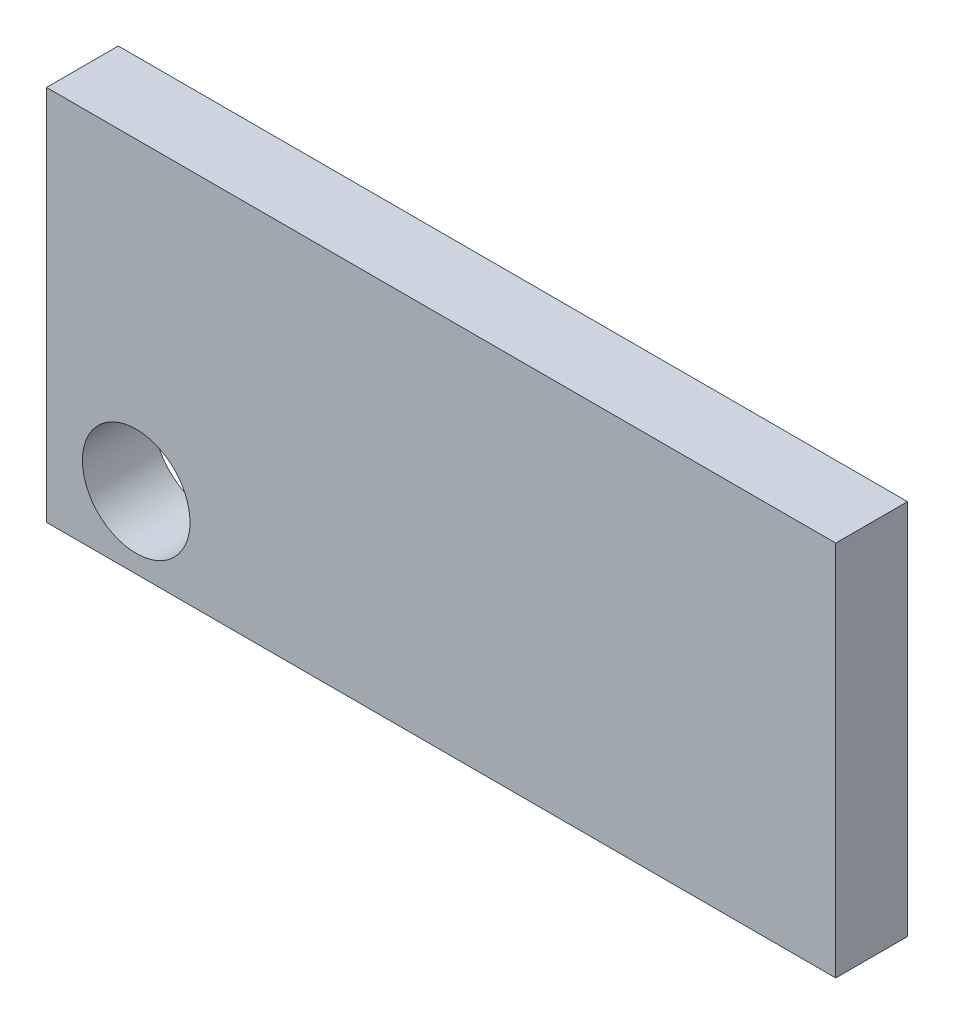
ISO-10303-21;
HEADER;
FILE_DESCRIPTION(('STEP AP214'),'2;1');
FILE_NAME('part.step','',(''),(''),'','','');
FILE_SCHEMA(('AUTOMOTIVE_DESIGN { 1 0 10303 214 1 1 1 1 }'));
ENDSEC;
DATA;
#1=APPLICATION_CONTEXT('core data for automotive mechanical design processes');
#2=APPLICATION_PROTOCOL_DEFINITION('international standard','automotive_design',2000,#1);
#3=PRODUCT_CONTEXT('',#1,'mechanical');
#4=PRODUCT('Part','Part','',(#3));
#5=PRODUCT_RELATED_PRODUCT_CATEGORY('part','',(#4));
#6=PRODUCT_DEFINITION_FORMATION('','',#4);
#7=PRODUCT_DEFINITION_CONTEXT('part definition',#1,'design');
#8=PRODUCT_DEFINITION('design','',#6,#7);
#9=PRODUCT_DEFINITION_SHAPE('','',#8);
#10=(LENGTH_UNIT() NAMED_UNIT(*) SI_UNIT(.MILLI.,.METRE.));
#11=(NAMED_UNIT(*) PLANE_ANGLE_UNIT() SI_UNIT($,.RADIAN.));
#12=(NAMED_UNIT(*) SI_UNIT($,.STERADIAN.) SOLID_ANGLE_UNIT());
#13=UNCERTAINTY_MEASURE_WITH_UNIT(LENGTH_MEASURE(1.E-05),#10,'distance_accuracy_value','');
#14=(GEOMETRIC_REPRESENTATION_CONTEXT(3) GLOBAL_UNCERTAINTY_ASSIGNED_CONTEXT((#13)) GLOBAL_UNIT_ASSIGNED_CONTEXT((#10,
#11,#12)) REPRESENTATION_CONTEXT('',''));
#15=CARTESIAN_POINT('',(0.,0.,0.));
#16=DIRECTION('',(0.,0.,1.));
#17=DIRECTION('',(1.,0.,0.));
#18=AXIS2_PLACEMENT_3D('',#15,#16,#17);
#19=CARTESIAN_POINT('',(127.,457.2,50.8));
#20=DIRECTION('',(0.,0.,-1.));
#21=DIRECTION('',(-1.,0.,0.));
#22=AXIS2_PLACEMENT_3D('',#19,#20,#21);
#23=PLANE('',#22);
#24=CARTESIAN_POINT('',(127.,457.2,50.8));
#25=DIRECTION('',(0.,0.,-1.));
#26=DIRECTION('',(-1.,0.,0.));
#27=AXIS2_PLACEMENT_3D('',#24,#25,#26);
#28=CIRCLE('',#27,4.88950000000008);
#29=CARTESIAN_POINT('',(122.1105,457.2,50.8));
#30=VERTEX_POINT('',#29);
#31=EDGE_CURVE('E11',#30,#30,#28,.T.);
#32=ORIENTED_EDGE('',*,*,#31,.T.);
#33=EDGE_LOOP('',(#32));
#34=FACE_BOUND('',#33,.T.);
#35=ADVANCED_FACE('F32',(#34),#23,.T.);
#36=CARTESIAN_POINT('',(127.,457.2,50.8));
#37=DIRECTION('',(0.,0.,-1.));
#38=DIRECTION('',(-1.,0.,0.));
#39=AXIS2_PLACEMENT_3D('',#36,#37,#38);
#40=CYLINDRICAL_SURFACE('',#39,4.88950000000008);
#41=ORIENTED_EDGE('',*,*,#31,.F.);
#42=EDGE_LOOP('',(#41));
#43=FACE_BOUND('',#42,.T.);
#44=CARTESIAN_POINT('',(127.,457.2,0.));
#45=DIRECTION('',(0.,0.,-1.));
#46=DIRECTION('',(-1.,0.,0.));
#47=AXIS2_PLACEMENT_3D('',#44,#45,#46);
#48=CIRCLE('',#47,4.88950000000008);
#49=CARTESIAN_POINT('',(122.1105,457.2,0.));
#50=VERTEX_POINT('',#49);
#51=EDGE_CURVE('E40',#50,#50,#48,.T.);
#52=ORIENTED_EDGE('',*,*,#51,.T.);
#53=EDGE_LOOP('',(#52));
#54=FACE_BOUND('',#53,.T.);
#55=ADVANCED_FACE('F153',(#43,#54),#40,.F.);
#56=CARTESIAN_POINT('',(228.6,457.2,50.8));
#57=DIRECTION('',(0.,0.,-1.));
#58=DIRECTION('',(-1.,0.,0.));
#59=AXIS2_PLACEMENT_3D('',#56,#57,#58);
#60=PLANE('',#59);
#61=CARTESIAN_POINT('',(228.6,457.2,50.8));
#62=DIRECTION('',(0.,0.,-1.));
#63=DIRECTION('',(-1.,0.,0.));
#64=AXIS2_PLACEMENT_3D('',#61,#62,#63);
#65=CIRCLE('',#64,4.88950000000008);
#66=CARTESIAN_POINT('',(223.7105,457.2,50.8));
#67=VERTEX_POINT('',#66);
#68=EDGE_CURVE('E148',#67,#67,#65,.T.);
#69=ORIENTED_EDGE('',*,*,#68,.T.);
#70=EDGE_LOOP('',(#69));
#71=FACE_BOUND('',#70,.T.);
#72=ADVANCED_FACE('F178',(#71),#60,.T.);
#73=CARTESIAN_POINT('',(228.6,457.2,50.8));
#74=DIRECTION('',(0.,0.,-1.));
#75=DIRECTION('',(-1.,0.,0.));
#76=AXIS2_PLACEMENT_3D('',#73,#74,#75);
#77=CYLINDRICAL_SURFACE('',#76,4.88950000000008);
#78=ORIENTED_EDGE('',*,*,#68,.F.);
#79=EDGE_LOOP('',(#78));
#80=FACE_BOUND('',#79,.T.);
#81=CARTESIAN_POINT('',(228.6,457.2,0.));
#82=DIRECTION('',(0.,0.,-1.));
#83=DIRECTION('',(-1.,0.,0.));
#84=AXIS2_PLACEMENT_3D('',#81,#82,#83);
#85=CIRCLE('',#84,4.88950000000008);
#86=CARTESIAN_POINT('',(223.7105,457.2,0.));
#87=VERTEX_POINT('',#86);
#88=EDGE_CURVE('E145',#87,#87,#85,.T.);
#89=ORIENTED_EDGE('',*,*,#88,.T.);
#90=EDGE_LOOP('',(#89));
#91=FACE_BOUND('',#90,.T.);
#92=ADVANCED_FACE('F184',(#80,#91),#77,.F.);
#93=CARTESIAN_POINT('',(330.2,457.2,50.8));
#94=DIRECTION('',(0.,0.,-1.));
#95=DIRECTION('',(-1.,0.,0.));
#96=AXIS2_PLACEMENT_3D('',#93,#94,#95);
#97=PLANE('',#96);
#98=CARTESIAN_POINT('',(330.2,457.2,50.8));
#99=DIRECTION('',(0.,0.,-1.));
#100=DIRECTION('',(-1.,0.,0.));
#101=AXIS2_PLACEMENT_3D('',#98,#99,#100);
#102=CIRCLE('',#101,4.88950000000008);
#103=CARTESIAN_POINT('',(325.3105,457.2,50.8));
#104=VERTEX_POINT('',#103);
#105=EDGE_CURVE('E142',#104,#104,#102,.T.);
#106=ORIENTED_EDGE('',*,*,#105,.T.);
#107=EDGE_LOOP('',(#106));
#108=FACE_BOUND('',#107,.T.);
#109=ADVANCED_FACE('F190',(#108),#97,.T.);
#110=CARTESIAN_POINT('',(330.2,457.2,50.8));
#111=DIRECTION('',(0.,0.,-1.));
#112=DIRECTION('',(-1.,0.,0.));
#113=AXIS2_PLACEMENT_3D('',#110,#111,#112);
#114=CYLINDRICAL_SURFACE('',#113,4.88950000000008);
#115=ORIENTED_EDGE('',*,*,#105,.F.);
#116=EDGE_LOOP('',(#115));
#117=FACE_BOUND('',#116,.T.);
#118=CARTESIAN_POINT('',(330.2,457.2,0.));
#119=DIRECTION('',(0.,0.,-1.));
#120=DIRECTION('',(-1.,0.,0.));
#121=AXIS2_PLACEMENT_3D('',#118,#119,#120);
#122=CIRCLE('',#121,4.88950000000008);
#123=CARTESIAN_POINT('',(325.3105,457.2,0.));
#124=VERTEX_POINT('',#123);
#125=EDGE_CURVE('E139',#124,#124,#122,.T.);
#126=ORIENTED_EDGE('',*,*,#125,.T.);
#127=EDGE_LOOP('',(#126));
#128=FACE_BOUND('',#127,.T.);
#129=ADVANCED_FACE('F194',(#117,#128),#114,.F.);
#130=CARTESIAN_POINT('',(431.8,457.2,50.8));
#131=DIRECTION('',(0.,0.,-1.));
#132=DIRECTION('',(-1.,0.,0.));
#133=AXIS2_PLACEMENT_3D('',#130,#131,#132);
#134=PLANE('',#133);
#135=CARTESIAN_POINT('',(431.8,457.2,50.8));
#136=DIRECTION('',(0.,0.,-1.));
#137=DIRECTION('',(-1.,0.,0.));
#138=AXIS2_PLACEMENT_3D('',#135,#136,#137);
#139=CIRCLE('',#138,4.88950000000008);
#140=CARTESIAN_POINT('',(426.9105,457.2,50.8));
#141=VERTEX_POINT('',#140);
#142=EDGE_CURVE('E136',#141,#141,#139,.T.);
#143=ORIENTED_EDGE('',*,*,#142,.T.);
#144=EDGE_LOOP('',(#143));
#145=FACE_BOUND('',#144,.T.);
#146=ADVANCED_FACE('F198',(#145),#134,.T.);
#147=CARTESIAN_POINT('',(431.8,457.2,50.8));
#148=DIRECTION('',(0.,0.,-1.));
#149=DIRECTION('',(-1.,0.,0.));
#150=AXIS2_PLACEMENT_3D('',#147,#148,#149);
#151=CYLINDRICAL_SURFACE('',#150,4.88950000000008);
#152=ORIENTED_EDGE('',*,*,#142,.F.);
#153=EDGE_LOOP('',(#152));
#154=FACE_BOUND('',#153,.T.);
#155=CARTESIAN_POINT('',(431.8,457.2,0.));
#156=DIRECTION('',(0.,0.,-1.));
#157=DIRECTION('',(-1.,0.,0.));
#158=AXIS2_PLACEMENT_3D('',#155,#156,#157);
#159=CIRCLE('',#158,4.88950000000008);
#160=CARTESIAN_POINT('',(426.9105,457.2,0.));
#161=VERTEX_POINT('',#160);
#162=EDGE_CURVE('E133',#161,#161,#159,.T.);
#163=ORIENTED_EDGE('',*,*,#162,.T.);
#164=EDGE_LOOP('',(#163));
#165=FACE_BOUND('',#164,.T.);
#166=ADVANCED_FACE('F202',(#154,#165),#151,.F.);
#167=CARTESIAN_POINT('',(533.4,457.2,50.8));
#168=DIRECTION('',(0.,0.,-1.));
#169=DIRECTION('',(-1.,0.,0.));
#170=AXIS2_PLACEMENT_3D('',#167,#168,#169);
#171=PLANE('',#170);
#172=CARTESIAN_POINT('',(533.4,457.2,50.8));
#173=DIRECTION('',(0.,0.,-1.));
#174=DIRECTION('',(-1.,0.,0.));
#175=AXIS2_PLACEMENT_3D('',#172,#173,#174);
#176=CIRCLE('',#175,4.88950000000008);
#177=CARTESIAN_POINT('',(528.5105,457.2,50.8));
#178=VERTEX_POINT('',#177);
#179=EDGE_CURVE('E130',#178,#178,#176,.T.);
#180=ORIENTED_EDGE('',*,*,#179,.T.);
#181=EDGE_LOOP('',(#180));
#182=FACE_BOUND('',#181,.T.);
#183=ADVANCED_FACE('F206',(#182),#171,.T.);
#184=CARTESIAN_POINT('',(533.4,457.2,50.8));
#185=DIRECTION('',(0.,0.,-1.));
#186=DIRECTION('',(-1.,0.,0.));
#187=AXIS2_PLACEMENT_3D('',#184,#185,#186);
#188=CYLINDRICAL_SURFACE('',#187,4.88950000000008);
#189=ORIENTED_EDGE('',*,*,#179,.F.);
#190=EDGE_LOOP('',(#189));
#191=FACE_BOUND('',#190,.T.);
#192=CARTESIAN_POINT('',(533.4,457.2,0.));
#193=DIRECTION('',(0.,0.,-1.));
#194=DIRECTION('',(-1.,0.,0.));
#195=AXIS2_PLACEMENT_3D('',#192,#193,#194);
#196=CIRCLE('',#195,4.88950000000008);
#197=CARTESIAN_POINT('',(528.5105,457.2,0.));
#198=VERTEX_POINT('',#197);
#199=EDGE_CURVE('E127',#198,#198,#196,.T.);
#200=ORIENTED_EDGE('',*,*,#199,.T.);
#201=EDGE_LOOP('',(#200));
#202=FACE_BOUND('',#201,.T.);
#203=ADVANCED_FACE('F210',(#191,#202),#188,.F.);
#204=CARTESIAN_POINT('',(635.,457.2,50.8));
#205=DIRECTION('',(0.,0.,-1.));
#206=DIRECTION('',(-1.,0.,0.));
#207=AXIS2_PLACEMENT_3D('',#204,#205,#206);
#208=PLANE('',#207);
#209=CARTESIAN_POINT('',(635.,457.2,50.8));
#210=DIRECTION('',(0.,0.,-1.));
#211=DIRECTION('',(-1.,0.,0.));
#212=AXIS2_PLACEMENT_3D('',#209,#210,#211);
#213=CIRCLE('',#212,4.88950000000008);
#214=CARTESIAN_POINT('',(630.1105,457.2,50.8));
#215=VERTEX_POINT('',#214);
#216=EDGE_CURVE('E124',#215,#215,#213,.T.);
#217=ORIENTED_EDGE('',*,*,#216,.T.);
#218=EDGE_LOOP('',(#217));
#219=FACE_BOUND('',#218,.T.);
#220=ADVANCED_FACE('F214',(#219),#208,.T.);
#221=CARTESIAN_POINT('',(635.,457.2,50.8));
#222=DIRECTION('',(0.,0.,-1.));
#223=DIRECTION('',(-1.,0.,0.));
#224=AXIS2_PLACEMENT_3D('',#221,#222,#223);
#225=CYLINDRICAL_SURFACE('',#224,4.88950000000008);
#226=ORIENTED_EDGE('',*,*,#216,.F.);
#227=EDGE_LOOP('',(#226));
#228=FACE_BOUND('',#227,.T.);
#229=CARTESIAN_POINT('',(635.,457.2,0.));
#230=DIRECTION('',(0.,0.,-1.));
#231=DIRECTION('',(-1.,0.,0.));
#232=AXIS2_PLACEMENT_3D('',#229,#230,#231);
#233=CIRCLE('',#232,4.88950000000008);
#234=CARTESIAN_POINT('',(630.1105,457.2,0.));
#235=VERTEX_POINT('',#234);
#236=EDGE_CURVE('E121',#235,#235,#233,.T.);
#237=ORIENTED_EDGE('',*,*,#236,.T.);
#238=EDGE_LOOP('',(#237));
#239=FACE_BOUND('',#238,.T.);
#240=ADVANCED_FACE('F218',(#228,#239),#225,.F.);
#241=CARTESIAN_POINT('',(736.6,457.2,50.8));
#242=DIRECTION('',(0.,0.,-1.));
#243=DIRECTION('',(-1.,0.,0.));
#244=AXIS2_PLACEMENT_3D('',#241,#242,#243);
#245=PLANE('',#244);
#246=CARTESIAN_POINT('',(736.6,457.2,50.8));
#247=DIRECTION('',(0.,0.,-1.));
#248=DIRECTION('',(-1.,0.,0.));
#249=AXIS2_PLACEMENT_3D('',#246,#247,#248);
#250=CIRCLE('',#249,4.88950000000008);
#251=CARTESIAN_POINT('',(731.7105,457.2,50.8));
#252=VERTEX_POINT('',#251);
#253=EDGE_CURVE('E118',#252,#252,#250,.T.);
#254=ORIENTED_EDGE('',*,*,#253,.T.);
#255=EDGE_LOOP('',(#254));
#256=FACE_BOUND('',#255,.T.);
#257=ADVANCED_FACE('F222',(#256),#245,.T.);
#258=CARTESIAN_POINT('',(736.6,457.2,50.8));
#259=DIRECTION('',(0.,0.,-1.));
#260=DIRECTION('',(-1.,0.,0.));
#261=AXIS2_PLACEMENT_3D('',#258,#259,#260);
#262=CYLINDRICAL_SURFACE('',#261,4.88950000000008);
#263=ORIENTED_EDGE('',*,*,#253,.F.);
#264=EDGE_LOOP('',(#263));
#265=FACE_BOUND('',#264,.T.);
#266=CARTESIAN_POINT('',(736.6,457.2,0.));
#267=DIRECTION('',(0.,0.,-1.));
#268=DIRECTION('',(-1.,0.,0.));
#269=AXIS2_PLACEMENT_3D('',#266,#267,#268);
#270=CIRCLE('',#269,4.88950000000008);
#271=CARTESIAN_POINT('',(731.7105,457.2,0.));
#272=VERTEX_POINT('',#271);
#273=EDGE_CURVE('E115',#272,#272,#270,.T.);
#274=ORIENTED_EDGE('',*,*,#273,.T.);
#275=EDGE_LOOP('',(#274));
#276=FACE_BOUND('',#275,.T.);
#277=ADVANCED_FACE('F226',(#265,#276),#262,.F.);
#278=CARTESIAN_POINT('',(838.2,457.2,50.8));
#279=DIRECTION('',(0.,0.,-1.));
#280=DIRECTION('',(-1.,0.,0.));
#281=AXIS2_PLACEMENT_3D('',#278,#279,#280);
#282=PLANE('',#281);
#283=CARTESIAN_POINT('',(838.2,457.2,50.8));
#284=DIRECTION('',(0.,0.,-1.));
#285=DIRECTION('',(-1.,0.,0.));
#286=AXIS2_PLACEMENT_3D('',#283,#284,#285);
#287=CIRCLE('',#286,4.88950000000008);
#288=CARTESIAN_POINT('',(833.3105,457.2,50.8));
#289=VERTEX_POINT('',#288);
#290=EDGE_CURVE('E112',#289,#289,#287,.T.);
#291=ORIENTED_EDGE('',*,*,#290,.T.);
#292=EDGE_LOOP('',(#291));
#293=FACE_BOUND('',#292,.T.);
#294=ADVANCED_FACE('F230',(#293),#282,.T.);
#295=CARTESIAN_POINT('',(838.2,457.2,50.8));
#296=DIRECTION('',(0.,0.,-1.));
#297=DIRECTION('',(-1.,0.,0.));
#298=AXIS2_PLACEMENT_3D('',#295,#296,#297);
#299=CYLINDRICAL_SURFACE('',#298,4.88950000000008);
#300=ORIENTED_EDGE('',*,*,#290,.F.);
#301=EDGE_LOOP('',(#300));
#302=FACE_BOUND('',#301,.T.);
#303=CARTESIAN_POINT('',(838.2,457.2,0.));
#304=DIRECTION('',(0.,0.,-1.));
#305=DIRECTION('',(-1.,0.,0.));
#306=AXIS2_PLACEMENT_3D('',#303,#304,#305);
#307=CIRCLE('',#306,4.88950000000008);
#308=CARTESIAN_POINT('',(833.3105,457.2,0.));
#309=VERTEX_POINT('',#308);
#310=EDGE_CURVE('E109',#309,#309,#307,.T.);
#311=ORIENTED_EDGE('',*,*,#310,.T.);
#312=EDGE_LOOP('',(#311));
#313=FACE_BOUND('',#312,.T.);
#314=ADVANCED_FACE('F234',(#302,#313),#299,.F.);
#315=CARTESIAN_POINT('',(0.,0.,101.6));
#316=DIRECTION('',(1.,0.,0.));
#317=DIRECTION('',(0.,0.,-1.));
#318=AXIS2_PLACEMENT_3D('',#315,#316,#317);
#319=PLANE('',#318);
#320=DIRECTION('',(0.,-1.,0.));
#321=VECTOR('',#320,1.);
#322=CARTESIAN_POINT('',(0.,0.,0.));
#323=LINE('',#322,#321);
#324=CARTESIAN_POINT('',(0.,533.4,0.));
#325=VERTEX_POINT('',#324);
#326=CARTESIAN_POINT('',(0.,0.,0.));
#327=VERTEX_POINT('',#326);
#328=EDGE_CURVE('E99',#325,#327,#323,.T.);
#329=ORIENTED_EDGE('',*,*,#328,.T.);
#330=DIRECTION('',(0.,0.,-1.));
#331=VECTOR('',#330,1.);
#332=CARTESIAN_POINT('',(0.,0.,101.6));
#333=LINE('',#332,#331);
#334=CARTESIAN_POINT('',(0.,0.,101.6));
#335=VERTEX_POINT('',#334);
#336=EDGE_CURVE('E90',#335,#327,#333,.T.);
#337=ORIENTED_EDGE('',*,*,#336,.F.);
#338=DIRECTION('',(0.,-1.,0.));
#339=VECTOR('',#338,1.);
#340=CARTESIAN_POINT('',(0.,0.,101.6));
#341=LINE('',#340,#339);
#342=CARTESIAN_POINT('',(0.,533.4,101.6));
#343=VERTEX_POINT('',#342);
#344=EDGE_CURVE('E84',#343,#335,#341,.T.);
#345=ORIENTED_EDGE('',*,*,#344,.F.);
#346=DIRECTION('',(0.,0.,-1.));
#347=VECTOR('',#346,1.);
#348=CARTESIAN_POINT('',(0.,533.4,101.6));
#349=LINE('',#348,#347);
#350=EDGE_CURVE('E95',#343,#325,#349,.T.);
#351=ORIENTED_EDGE('',*,*,#350,.T.);
#352=EDGE_LOOP('',(#329,#337,#345,#351));
#353=FACE_BOUND('',#352,.T.);
#354=ADVANCED_FACE('F238',(#353),#319,.F.);
#355=CARTESIAN_POINT('',(0.,0.,101.6));
#356=DIRECTION('',(0.,1.,0.));
#357=DIRECTION('',(0.,0.,1.));
#358=AXIS2_PLACEMENT_3D('',#355,#356,#357);
#359=PLANE('',#358);
#360=DIRECTION('',(1.,0.,0.));
#361=VECTOR('',#360,1.);
#362=CARTESIAN_POINT('',(0.,0.,0.));
#363=LINE('',#362,#361);
#364=CARTESIAN_POINT('',(1117.6,0.,0.));
#365=VERTEX_POINT('',#364);
#366=EDGE_CURVE('E89',#327,#365,#363,.T.);
#367=ORIENTED_EDGE('',*,*,#366,.T.);
#368=DIRECTION('',(0.,0.,-1.));
#369=VECTOR('',#368,1.);
#370=CARTESIAN_POINT('',(1117.6,0.,101.6));
#371=LINE('',#370,#369);
#372=CARTESIAN_POINT('',(1117.6,0.,101.6));
#373=VERTEX_POINT('',#372);
#374=EDGE_CURVE('E87',#373,#365,#371,.T.);
#375=ORIENTED_EDGE('',*,*,#374,.F.);
#376=DIRECTION('',(1.,0.,0.));
#377=VECTOR('',#376,1.);
#378=CARTESIAN_POINT('',(0.,0.,101.6));
#379=LINE('',#378,#377);
#380=EDGE_CURVE('E79',#335,#373,#379,.T.);
#381=ORIENTED_EDGE('',*,*,#380,.F.);
#382=ORIENTED_EDGE('',*,*,#336,.T.);
#383=EDGE_LOOP('',(#367,#375,#381,#382));
#384=FACE_BOUND('',#383,.T.);
#385=ADVANCED_FACE('F88',(#384),#359,.F.);
#386=CARTESIAN_POINT('',(1117.6,0.,101.6));
#387=DIRECTION('',(-1.,0.,0.));
#388=DIRECTION('',(0.,0.,1.));
#389=AXIS2_PLACEMENT_3D('',#386,#387,#388);
#390=PLANE('',#389);
#391=DIRECTION('',(0.,1.,0.));
#392=VECTOR('',#391,1.);
#393=CARTESIAN_POINT('',(1117.6,0.,0.));
#394=LINE('',#393,#392);
#395=CARTESIAN_POINT('',(1117.6,533.4,0.));
#396=VERTEX_POINT('',#395);
#397=EDGE_CURVE('E65',#365,#396,#394,.T.);
#398=ORIENTED_EDGE('',*,*,#397,.T.);
#399=DIRECTION('',(0.,0.,-1.));
#400=VECTOR('',#399,1.);
#401=CARTESIAN_POINT('',(1117.6,533.4,101.6));
#402=LINE('',#401,#400);
#403=CARTESIAN_POINT('',(1117.6,533.4,101.6));
#404=VERTEX_POINT('',#403);
#405=EDGE_CURVE('E91',#404,#396,#402,.T.);
#406=ORIENTED_EDGE('',*,*,#405,.F.);
#407=DIRECTION('',(0.,1.,0.));
#408=VECTOR('',#407,1.);
#409=CARTESIAN_POINT('',(1117.6,0.,101.6));
#410=LINE('',#409,#408);
#411=EDGE_CURVE('E82',#373,#404,#410,.T.);
#412=ORIENTED_EDGE('',*,*,#411,.F.);
#413=ORIENTED_EDGE('',*,*,#374,.T.);
#414=EDGE_LOOP('',(#398,#406,#412,#413));
#415=FACE_BOUND('',#414,.T.);
#416=ADVANCED_FACE('F93',(#415),#390,.F.);
#417=CARTESIAN_POINT('',(0.,533.4,101.6));
#418=DIRECTION('',(0.,-1.,0.));
#419=DIRECTION('',(0.,0.,-1.));
#420=AXIS2_PLACEMENT_3D('',#417,#418,#419);
#421=PLANE('',#420);
#422=DIRECTION('',(-1.,0.,0.));
#423=VECTOR('',#422,1.);
#424=CARTESIAN_POINT('',(0.,533.4,0.));
#425=LINE('',#424,#423);
#426=EDGE_CURVE('E71',#396,#325,#425,.T.);
#427=ORIENTED_EDGE('',*,*,#426,.T.);
#428=ORIENTED_EDGE('',*,*,#350,.F.);
#429=DIRECTION('',(-1.,0.,0.));
#430=VECTOR('',#429,1.);
#431=CARTESIAN_POINT('',(0.,533.4,101.6));
#432=LINE('',#431,#430);
#433=EDGE_CURVE('E48',#404,#343,#432,.T.);
#434=ORIENTED_EDGE('',*,*,#433,.F.);
#435=ORIENTED_EDGE('',*,*,#405,.T.);
#436=EDGE_LOOP('',(#427,#428,#434,#435));
#437=FACE_BOUND('',#436,.T.);
#438=ADVANCED_FACE('F167',(#437),#421,.F.);
#439=CARTESIAN_POINT('',(0.,0.,101.6));
#440=DIRECTION('',(0.,0.,-1.));
#441=DIRECTION('',(-1.,0.,0.));
#442=AXIS2_PLACEMENT_3D('',#439,#440,#441);
#443=PLANE('',#442);
#444=CARTESIAN_POINT('',(127.,101.6,101.6));
#445=DIRECTION('',(0.,0.,-1.));
#446=DIRECTION('',(-1.,0.,0.));
#447=AXIS2_PLACEMENT_3D('',#444,#445,#446);
#448=CIRCLE('',#447,76.2);
#449=CARTESIAN_POINT('',(50.8,101.6,101.6));
#450=VERTEX_POINT('',#449);
#451=EDGE_CURVE('E102',#450,#450,#448,.T.);
#452=ORIENTED_EDGE('',*,*,#451,.T.);
#453=EDGE_LOOP('',(#452));
#454=FACE_BOUND('',#453,.T.);
#455=ORIENTED_EDGE('',*,*,#344,.T.);
#456=ORIENTED_EDGE('',*,*,#380,.T.);
#457=ORIENTED_EDGE('',*,*,#411,.T.);
#458=ORIENTED_EDGE('',*,*,#433,.T.);
#459=EDGE_LOOP('',(#455,#456,#457,#458));
#460=FACE_BOUND('',#459,.T.);
#461=ADVANCED_FACE('F80',(#454,#460),#443,.F.);
#462=CARTESIAN_POINT('',(0.,0.,0.));
#463=DIRECTION('',(0.,0.,-1.));
#464=DIRECTION('',(-1.,0.,0.));
#465=AXIS2_PLACEMENT_3D('',#462,#463,#464);
#466=PLANE('',#465);
#467=CARTESIAN_POINT('',(939.8,457.2,0.));
#468=DIRECTION('',(0.,0.,-1.));
#469=DIRECTION('',(-1.,0.,0.));
#470=AXIS2_PLACEMENT_3D('',#467,#468,#469);
#471=CIRCLE('',#470,4.88950000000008);
#472=CARTESIAN_POINT('',(934.9105,457.2,0.));
#473=VERTEX_POINT('',#472);
#474=EDGE_CURVE('E404',#473,#473,#471,.T.);
#475=ORIENTED_EDGE('',*,*,#474,.F.);
#476=EDGE_LOOP('',(#475));
#477=FACE_BOUND('',#476,.T.);
#478=CARTESIAN_POINT('',(1041.4,457.2,0.));
#479=DIRECTION('',(0.,0.,-1.));
#480=DIRECTION('',(-1.,0.,0.));
#481=AXIS2_PLACEMENT_3D('',#478,#479,#480);
#482=CIRCLE('',#481,4.88950000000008);
#483=CARTESIAN_POINT('',(1036.5105,457.2,0.));
#484=VERTEX_POINT('',#483);
#485=EDGE_CURVE('E403',#484,#484,#482,.T.);
#486=ORIENTED_EDGE('',*,*,#485,.F.);
#487=EDGE_LOOP('',(#486));
#488=FACE_BOUND('',#487,.T.);
#489=CARTESIAN_POINT('',(127.,101.6,0.));
#490=DIRECTION('',(0.,0.,-1.));
#491=DIRECTION('',(-1.,0.,0.));
#492=AXIS2_PLACEMENT_3D('',#489,#490,#491);
#493=CIRCLE('',#492,76.2);
#494=CARTESIAN_POINT('',(50.8,101.6,0.));
#495=VERTEX_POINT('',#494);
#496=EDGE_CURVE('E413',#495,#495,#493,.T.);
#497=ORIENTED_EDGE('',*,*,#496,.F.);
#498=EDGE_LOOP('',(#497));
#499=FACE_BOUND('',#498,.T.);
#500=ORIENTED_EDGE('',*,*,#328,.F.);
#501=ORIENTED_EDGE('',*,*,#426,.F.);
#502=ORIENTED_EDGE('',*,*,#397,.F.);
#503=ORIENTED_EDGE('',*,*,#366,.F.);
#504=EDGE_LOOP('',(#500,#501,#502,#503));
#505=FACE_BOUND('',#504,.T.);
#506=ORIENTED_EDGE('',*,*,#310,.F.);
#507=EDGE_LOOP('',(#506));
#508=FACE_BOUND('',#507,.T.);
#509=ORIENTED_EDGE('',*,*,#273,.F.);
#510=EDGE_LOOP('',(#509));
#511=FACE_BOUND('',#510,.T.);
#512=ORIENTED_EDGE('',*,*,#236,.F.);
#513=EDGE_LOOP('',(#512));
#514=FACE_BOUND('',#513,.T.);
#515=ORIENTED_EDGE('',*,*,#199,.F.);
#516=EDGE_LOOP('',(#515));
#517=FACE_BOUND('',#516,.T.);
#518=ORIENTED_EDGE('',*,*,#162,.F.);
#519=EDGE_LOOP('',(#518));
#520=FACE_BOUND('',#519,.T.);
#521=ORIENTED_EDGE('',*,*,#125,.F.);
#522=EDGE_LOOP('',(#521));
#523=FACE_BOUND('',#522,.T.);
#524=ORIENTED_EDGE('',*,*,#88,.F.);
#525=EDGE_LOOP('',(#524));
#526=FACE_BOUND('',#525,.T.);
#527=ORIENTED_EDGE('',*,*,#51,.F.);
#528=EDGE_LOOP('',(#527));
#529=FACE_BOUND('',#528,.T.);
#530=ADVANCED_FACE('F155',(#477,#488,#499,#505,#508,#511,#514,#517,#520,#523,#526,#529),#466,.T.);
#531=CARTESIAN_POINT('',(127.,101.6,101.6));
#532=DIRECTION('',(0.,0.,-1.));
#533=DIRECTION('',(-1.,0.,0.));
#534=AXIS2_PLACEMENT_3D('',#531,#532,#533);
#535=CYLINDRICAL_SURFACE('',#534,76.2);
#536=ORIENTED_EDGE('',*,*,#451,.F.);
#537=EDGE_LOOP('',(#536));
#538=FACE_BOUND('',#537,.T.);
#539=ORIENTED_EDGE('',*,*,#496,.T.);
#540=EDGE_LOOP('',(#539));
#541=FACE_BOUND('',#540,.T.);
#542=ADVANCED_FACE('F157',(#538,#541),#535,.F.);
#543=CARTESIAN_POINT('',(1041.4,457.2,50.8));
#544=DIRECTION('',(0.,0.,-1.));
#545=DIRECTION('',(-1.,0.,0.));
#546=AXIS2_PLACEMENT_3D('',#543,#544,#545);
#547=CYLINDRICAL_SURFACE('',#546,4.88950000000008);
#548=CARTESIAN_POINT('',(1041.4,457.2,50.8));
#549=DIRECTION('',(0.,0.,-1.));
#550=DIRECTION('',(-1.,0.,0.));
#551=AXIS2_PLACEMENT_3D('',#548,#549,#550);
#552=CIRCLE('',#551,4.88950000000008);
#553=CARTESIAN_POINT('',(1036.5105,457.2,50.8));
#554=VERTEX_POINT('',#553);
#555=EDGE_CURVE('E407',#554,#554,#552,.T.);
#556=ORIENTED_EDGE('',*,*,#555,.F.);
#557=EDGE_LOOP('',(#556));
#558=FACE_BOUND('',#557,.T.);
#559=ORIENTED_EDGE('',*,*,#485,.T.);
#560=EDGE_LOOP('',(#559));
#561=FACE_BOUND('',#560,.T.);
#562=ADVANCED_FACE('F164',(#558,#561),#547,.F.);
#563=CARTESIAN_POINT('',(1041.4,457.2,50.8));
#564=DIRECTION('',(0.,0.,-1.));
#565=DIRECTION('',(-1.,0.,0.));
#566=AXIS2_PLACEMENT_3D('',#563,#564,#565);
#567=PLANE('',#566);
#568=ORIENTED_EDGE('',*,*,#555,.T.);
#569=EDGE_LOOP('',(#568));
#570=FACE_BOUND('',#569,.T.);
#571=ADVANCED_FACE('F271',(#570),#567,.T.);
#572=CARTESIAN_POINT('',(939.8,457.2,50.8));
#573=DIRECTION('',(0.,0.,-1.));
#574=DIRECTION('',(-1.,0.,0.));
#575=AXIS2_PLACEMENT_3D('',#572,#573,#574);
#576=CYLINDRICAL_SURFACE('',#575,4.88950000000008);
#577=CARTESIAN_POINT('',(939.8,457.2,50.8));
#578=DIRECTION('',(0.,0.,-1.));
#579=DIRECTION('',(-1.,0.,0.));
#580=AXIS2_PLACEMENT_3D('',#577,#578,#579);
#581=CIRCLE('',#580,4.88950000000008);
#582=CARTESIAN_POINT('',(934.9105,457.2,50.8));
#583=VERTEX_POINT('',#582);
#584=EDGE_CURVE('E402',#583,#583,#581,.T.);
#585=ORIENTED_EDGE('',*,*,#584,.F.);
#586=EDGE_LOOP('',(#585));
#587=FACE_BOUND('',#586,.T.);
#588=ORIENTED_EDGE('',*,*,#474,.T.);
#589=EDGE_LOOP('',(#588));
#590=FACE_BOUND('',#589,.T.);
#591=ADVANCED_FACE('F280',(#587,#590),#576,.F.);
#592=CARTESIAN_POINT('',(939.8,457.2,50.8));
#593=DIRECTION('',(0.,0.,-1.));
#594=DIRECTION('',(-1.,0.,0.));
#595=AXIS2_PLACEMENT_3D('',#592,#593,#594);
#596=PLANE('',#595);
#597=ORIENTED_EDGE('',*,*,#584,.T.);
#598=EDGE_LOOP('',(#597));
#599=FACE_BOUND('',#598,.T.);
#600=ADVANCED_FACE('F386',(#599),#596,.T.);
#601=CLOSED_SHELL('',(#35,#55,#72,#92,#109,#129,#146,#166,#183,#203,#220,#240,#257,#277,#294,
#314,#354,#385,#416,#438,#461,#530,#542,#562,#571,#591,#600));
#602=MANIFOLD_SOLID_BREP('B2',#601);
#603=ADVANCED_BREP_SHAPE_REPRESENTATION('',(#18,#602),#14);
#604=SHAPE_DEFINITION_REPRESENTATION(#9,#603);
ENDSEC;
END-ISO-10303-21;
